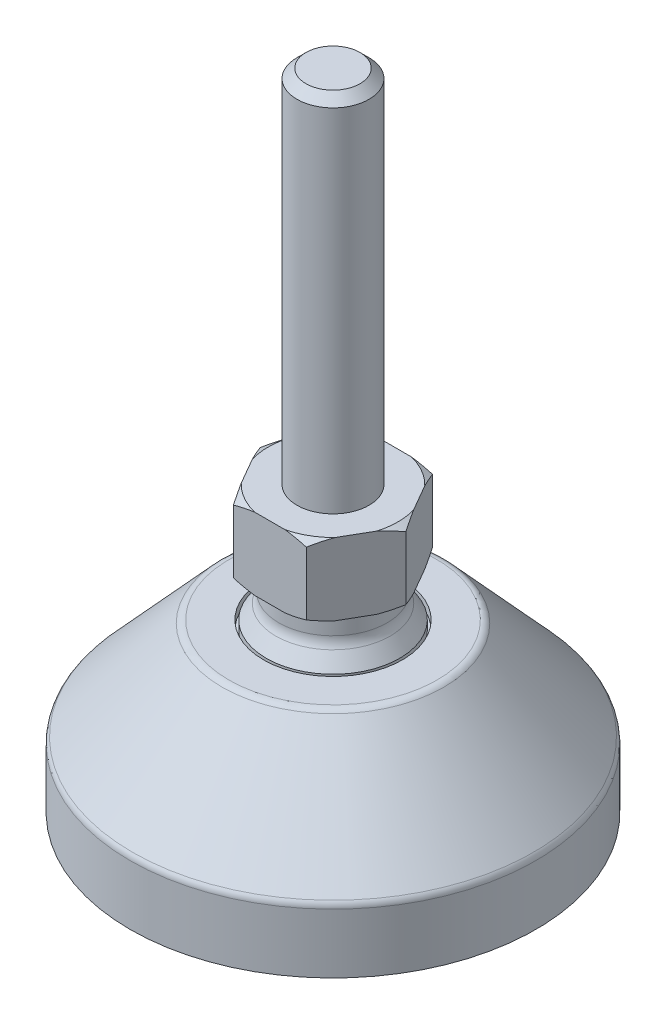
from build123d import *

# Parameters (mm, degrees)
SKETCH1_R           = 18
BOSS_EXTRUDE1_DEPTH = 2.5
SKETCH2_R           = 22.5
BOSS_EXTRUDE2_DEPTH = 7
SKETCH3_R           = 12
SKETCH4_R           = 7.4
SKETCH5_R           = 6
SKETCH11_R          = 7.7
SKETCH11_R_2        = 7.4
CUT_EXTRUDE1_DEPTH  = 1
SKETCH6_R           = 6
BOSS_EXTRUDE3_DEPTH = 2.9
SKETCH7_R           = 4
BOSS_EXTRUDE4_DEPTH = 48
SKETCH8_R           = 4
BOSS_EXTRUDE5_DEPTH = 8
CHAMFER1_SIZE       = 1
BOSS_EXTRUDE6_DEPTH = 1
FILLET1_R           = 1
FILLET2_R           = 2


with BuildPart() as part:
    # Sketch1 → Boss-Extrude1 (new body)
    with BuildSketch(Plane(origin=(0, 0, 0), x_dir=(1, 0, 0), z_dir=(0, 1, 0))):
        with Locations(Location((0, 0, 0), (0, 0, 270))):
            Circle(SKETCH1_R)
    extrude(amount=BOSS_EXTRUDE1_DEPTH)

    # Sketch2 → Boss-Extrude2 (add)
    with BuildSketch(Plane(origin=(0, 2.5, 0), x_dir=(1, 0, 0), z_dir=(0, 1, 0))):
        with Locations(Location((0, 0, 0), (0, 0, 270))):
            Circle(SKETCH2_R)
    extrude(amount=BOSS_EXTRUDE2_DEPTH)

    # Sketch3 → section 1 of loft1
    with BuildSketch(Plane(origin=(0, 21, 0), x_dir=(1, 0, 0), z_dir=(0, 1, 0)), mode=Mode.PRIVATE) as loft1_s1:
        Circle(SKETCH3_R)
    # loft up to a face of the part (loft1)
    loft([Face(Wire([part.edges().sort_by_distance((16.401794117, 9.5, -15.402309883))[0]])), loft1_s1.sketch])

    # Sketch4 → Loft2 section 0
    with BuildSketch(Plane(origin=(0, 21, 0), x_dir=(1, 0, 0), z_dir=(0, 1, 0))):
        Circle(SKETCH4_R)
    # Sketch5 → Loft2 section 1
    with BuildSketch(Plane(origin=(0, 23.1, 0), x_dir=(1, 0, 0), z_dir=(0, 1, 0))):
        Circle(SKETCH5_R)
    loft()

    # Sketch11 → Cut-Extrude1 (cut)
    with BuildSketch(Plane(origin=(0, 21, 0), x_dir=(1, 0, 0), z_dir=(0, 1, 0))):
        with Locations(Location((0, 0, 0), (0, 0, 270))):
            Circle(SKETCH11_R)
        with Locations(Location((0, 0, 0), (0, 0, 270))):
            Circle(SKETCH11_R_2, mode=Mode.SUBTRACT)
    extrude(amount=-CUT_EXTRUDE1_DEPTH, mode=Mode.SUBTRACT)

    # Sketch6 → Boss-Extrude3 (add)
    with BuildSketch(Plane(origin=(0, 23.1, 0), x_dir=(1, 0, 0), z_dir=(0, 1, 0))):
        with Locations(Location((0, 0, 0), (0, 0, 270))):
            Circle(SKETCH6_R)
    extrude(amount=BOSS_EXTRUDE3_DEPTH)

    # Sketch7 → Boss-Extrude4 (add)
    with BuildSketch(Plane(origin=(0, 26, 0), x_dir=(1, 0, 0), z_dir=(0, 1, 0))):
        with Locations(Location((0, 0, 0), (0, 0, 270))):
            Circle(SKETCH7_R)
    extrude(amount=BOSS_EXTRUDE4_DEPTH)

    # Sketch8 → Boss-Extrude5 (add)
    with BuildSketch(Plane(origin=(0, 26, 0), x_dir=(1, 0, 0), z_dir=(0, 1, 0))):
        Polygon((8.082903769, 0), (4.041451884, 7), (-4.041451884, 7), (-8.082903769, 0), (-4.041451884, -7), (4.041451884, -7), align=None)
        with Locations(Location((0, 0, 0), (0, 0, 270))):
            Circle(SKETCH8_R, mode=Mode.SUBTRACT)
    extrude(amount=BOSS_EXTRUDE5_DEPTH)

    # Sketch9 → Cut-Revolve1 (revolve, cut)
    with BuildSketch(Plane.XY, mode=Mode.PRIVATE) as cut_revolve1_sk:
        Polygon((-7.2, 34), (-8.082903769, 33.5), (-8.082903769, 34), align=None)
        Polygon((-8.082903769, 26.5), (-7.2, 26), (-8.082903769, 26), align=None)
    revolve(cut_revolve1_sk.sketch.rotate(Axis((0, 74, 0), (0, -1, 0)), 90), axis=Axis((0, 74, 0), (0, -1, 0)), mode=Mode.SUBTRACT)

    # Chamfer1
    chamfer1_edges = [part.edges().sort_by_distance(p)[0] for p in [
        (0, 74, -4),
    ]]
    chamfer(chamfer1_edges, length=CHAMFER1_SIZE)

    # Sketch10 → Boss-Extrude6 (add)
    with BuildSketch(Plane.XZ):
        with BuildLine():
            Line((3, 6), (12.371843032, 6))
            ThreePointArc((12.371843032, 6), (8.534213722, 10.780987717), (3, 13.4187369))
            Line((3, 13.4187369), (3, 6))
        make_face()
        with BuildLine():
            Line((-3, -13.4187369), (-3, -6))
            Line((-3, -6), (-12.371843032, -6))
            ThreePointArc((-12.371843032, -6), (-8.534213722, -10.780987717), (-3, -13.4187369))
        make_face()
        with BuildLine():
            Line((3, -13.4187369), (3, -6))
            Line((3, -6), (12.371843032, -6))
            ThreePointArc((12.371843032, -6), (8.534213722, -10.780987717), (3, -13.4187369))
        make_face()
        with BuildLine():
            Line((-12.371843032, 6), (-3, 6))
            Line((-3, 6), (-3, 13.4187369))
            ThreePointArc((-3, 13.4187369), (-8.534213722, 10.780987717), (-12.371843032, 6))
        make_face()
    extrude(amount=BOSS_EXTRUDE6_DEPTH)

    # Fillet1
    fillet1_edges = [part.edges().sort_by_distance(p)[0] for p in [
        (0, 21, -12),
        (0, 9.5, -22.5),
    ]]
    fillet(fillet1_edges, radius=FILLET1_R)

    # Fillet2
    fillet2_edges = [part.edges().sort_by_distance(p)[0] for p in [
        (-4.242640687, 23.1, -4.242640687),
    ]]
    fillet(fillet2_edges, radius=FILLET2_R)


solid = part.part
